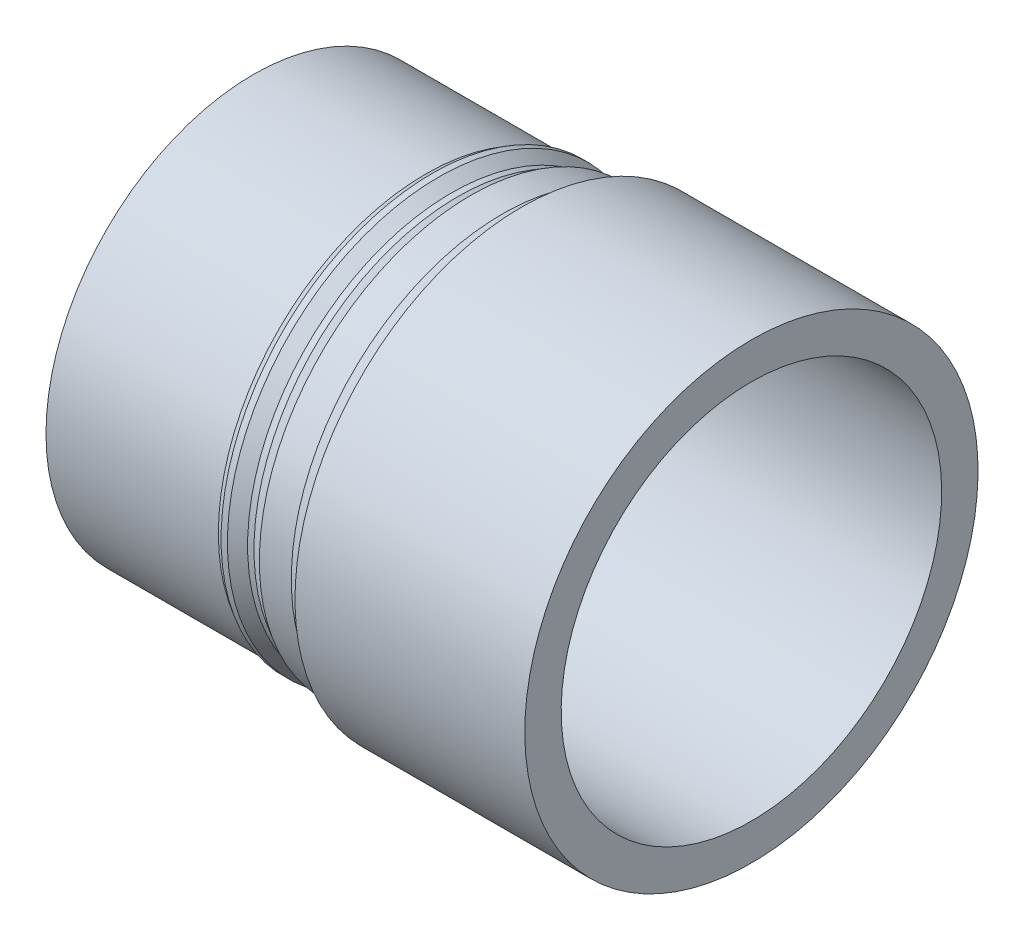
ISO-10303-21;
HEADER;
FILE_DESCRIPTION(('STEP AP214'),'2;1');
FILE_NAME('part.step','',(''),(''),'','','');
FILE_SCHEMA(('AUTOMOTIVE_DESIGN { 1 0 10303 214 1 1 1 1 }'));
ENDSEC;
DATA;
#1=APPLICATION_CONTEXT('core data for automotive mechanical design processes');
#2=APPLICATION_PROTOCOL_DEFINITION('international standard','automotive_design',2000,#1);
#3=PRODUCT_CONTEXT('',#1,'mechanical');
#4=PRODUCT('Part','Part','',(#3));
#5=PRODUCT_RELATED_PRODUCT_CATEGORY('part','',(#4));
#6=PRODUCT_DEFINITION_FORMATION('','',#4);
#7=PRODUCT_DEFINITION_CONTEXT('part definition',#1,'design');
#8=PRODUCT_DEFINITION('design','',#6,#7);
#9=PRODUCT_DEFINITION_SHAPE('','',#8);
#10=(LENGTH_UNIT() NAMED_UNIT(*) SI_UNIT(.MILLI.,.METRE.));
#11=(NAMED_UNIT(*) PLANE_ANGLE_UNIT() SI_UNIT($,.RADIAN.));
#12=(NAMED_UNIT(*) SI_UNIT($,.STERADIAN.) SOLID_ANGLE_UNIT());
#13=UNCERTAINTY_MEASURE_WITH_UNIT(LENGTH_MEASURE(1.E-05),#10,'distance_accuracy_value','');
#14=(GEOMETRIC_REPRESENTATION_CONTEXT(3) GLOBAL_UNCERTAINTY_ASSIGNED_CONTEXT((#13)) GLOBAL_UNIT_ASSIGNED_CONTEXT((#10,
#11,#12)) REPRESENTATION_CONTEXT('',''));
#15=CARTESIAN_POINT('',(0.,0.,0.));
#16=DIRECTION('',(0.,0.,1.));
#17=DIRECTION('',(1.,0.,0.));
#18=AXIS2_PLACEMENT_3D('',#15,#16,#17);
#19=CARTESIAN_POINT('',(0.,0.,0.));
#20=DIRECTION('',(-1.,0.,0.));
#21=DIRECTION('',(0.,0.,1.));
#22=AXIS2_PLACEMENT_3D('',#19,#20,#21);
#23=PLANE('',#22);
#24=CARTESIAN_POINT('',(0.,0.,0.));
#25=DIRECTION('',(1.,0.,0.));
#26=DIRECTION('',(0.,1.,0.));
#27=AXIS2_PLACEMENT_3D('',#24,#25,#26);
#28=CIRCLE('',#27,29.8);
#29=CARTESIAN_POINT('',(0.,29.8,0.));
#30=VERTEX_POINT('',#29);
#31=EDGE_CURVE('E69',#30,#30,#28,.T.);
#32=ORIENTED_EDGE('',*,*,#31,.T.);
#33=EDGE_LOOP('',(#32));
#34=FACE_BOUND('',#33,.T.);
#35=CARTESIAN_POINT('',(0.,0.,0.));
#36=DIRECTION('',(1.,0.,0.));
#37=DIRECTION('',(0.,0.,-1.));
#38=AXIS2_PLACEMENT_3D('',#35,#36,#37);
#39=CIRCLE('',#38,32.5);
#40=CARTESIAN_POINT('',(0.,0.,-32.5));
#41=VERTEX_POINT('',#40);
#42=EDGE_CURVE('E10',#41,#41,#39,.T.);
#43=ORIENTED_EDGE('',*,*,#42,.F.);
#44=EDGE_LOOP('',(#43));
#45=FACE_BOUND('',#44,.T.);
#46=ADVANCED_FACE('F31',(#34,#45),#23,.T.);
#47=CARTESIAN_POINT('',(42.,0.,0.));
#48=DIRECTION('',(1.,0.,0.));
#49=DIRECTION('',(0.,0.,-1.));
#50=AXIS2_PLACEMENT_3D('',#47,#48,#49);
#51=CYLINDRICAL_SURFACE('',#50,32.5);
#52=ORIENTED_EDGE('',*,*,#42,.T.);
#53=EDGE_LOOP('',(#52));
#54=FACE_BOUND('',#53,.T.);
#55=CARTESIAN_POINT('',(27.,0.,0.));
#56=DIRECTION('',(1.,0.,0.));
#57=DIRECTION('',(0.,0.,-1.));
#58=AXIS2_PLACEMENT_3D('',#55,#56,#57);
#59=CIRCLE('',#58,32.5);
#60=CARTESIAN_POINT('',(27.,0.,-32.5));
#61=VERTEX_POINT('',#60);
#62=EDGE_CURVE('E37',#61,#61,#59,.T.);
#63=ORIENTED_EDGE('',*,*,#62,.F.);
#64=EDGE_LOOP('',(#63));
#65=FACE_BOUND('',#64,.T.);
#66=ADVANCED_FACE('F106',(#54,#65),#51,.T.);
#67=CARTESIAN_POINT('',(28.,0.,0.));
#68=DIRECTION('',(1.,0.,0.));
#69=DIRECTION('',(0.,0.,-1.));
#70=AXIS2_PLACEMENT_3D('',#67,#68,#69);
#71=CONICAL_SURFACE('',#70,33.0773502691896,0.523598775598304);
#72=ORIENTED_EDGE('',*,*,#62,.T.);
#73=EDGE_LOOP('',(#72));
#74=FACE_BOUND('',#73,.T.);
#75=CARTESIAN_POINT('',(28.,0.,0.));
#76=DIRECTION('',(1.,0.,0.));
#77=DIRECTION('',(0.,0.,-1.));
#78=AXIS2_PLACEMENT_3D('',#75,#76,#77);
#79=CIRCLE('',#78,33.0773502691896);
#80=CARTESIAN_POINT('',(28.,0.,-33.0773502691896));
#81=VERTEX_POINT('',#80);
#82=EDGE_CURVE('E41',#81,#81,#79,.T.);
#83=ORIENTED_EDGE('',*,*,#82,.F.);
#84=EDGE_LOOP('',(#83));
#85=FACE_BOUND('',#84,.T.);
#86=ADVANCED_FACE('F110',(#74,#85),#71,.T.);
#87=CARTESIAN_POINT('',(42.,0.,0.));
#88=DIRECTION('',(1.,0.,0.));
#89=DIRECTION('',(0.,0.,-1.));
#90=AXIS2_PLACEMENT_3D('',#87,#88,#89);
#91=CYLINDRICAL_SURFACE('',#90,33.0773502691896);
#92=ORIENTED_EDGE('',*,*,#82,.T.);
#93=EDGE_LOOP('',(#92));
#94=FACE_BOUND('',#93,.T.);
#95=CARTESIAN_POINT('',(29.,0.,0.));
#96=DIRECTION('',(1.,0.,0.));
#97=DIRECTION('',(0.,0.,-1.));
#98=AXIS2_PLACEMENT_3D('',#95,#96,#97);
#99=CIRCLE('',#98,33.0773502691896);
#100=CARTESIAN_POINT('',(29.,0.,-33.0773502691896));
#101=VERTEX_POINT('',#100);
#102=EDGE_CURVE('E45',#101,#101,#99,.T.);
#103=ORIENTED_EDGE('',*,*,#102,.F.);
#104=EDGE_LOOP('',(#103));
#105=FACE_BOUND('',#104,.T.);
#106=ADVANCED_FACE('F114',(#94,#105),#91,.T.);
#107=CARTESIAN_POINT('',(31.,0.,0.));
#108=DIRECTION('',(-1.,0.,0.));
#109=DIRECTION('',(0.,0.,1.));
#110=AXIS2_PLACEMENT_3D('',#107,#108,#109);
#111=CONICAL_SURFACE('',#110,31.9226497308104,0.523598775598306);
#112=ORIENTED_EDGE('',*,*,#102,.T.);
#113=EDGE_LOOP('',(#112));
#114=FACE_BOUND('',#113,.T.);
#115=CARTESIAN_POINT('',(31.,0.,0.));
#116=DIRECTION('',(1.,0.,0.));
#117=DIRECTION('',(0.,0.,-1.));
#118=AXIS2_PLACEMENT_3D('',#115,#116,#117);
#119=CIRCLE('',#118,31.9226497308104);
#120=CARTESIAN_POINT('',(31.,0.,-31.9226497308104));
#121=VERTEX_POINT('',#120);
#122=EDGE_CURVE('E50',#121,#121,#119,.T.);
#123=ORIENTED_EDGE('',*,*,#122,.F.);
#124=EDGE_LOOP('',(#123));
#125=FACE_BOUND('',#124,.T.);
#126=ADVANCED_FACE('F120',(#114,#125),#111,.T.);
#127=CARTESIAN_POINT('',(42.,0.,0.));
#128=DIRECTION('',(1.,0.,0.));
#129=DIRECTION('',(0.,0.,-1.));
#130=AXIS2_PLACEMENT_3D('',#127,#128,#129);
#131=CYLINDRICAL_SURFACE('',#130,31.9226497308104);
#132=ORIENTED_EDGE('',*,*,#122,.T.);
#133=EDGE_LOOP('',(#132));
#134=FACE_BOUND('',#133,.T.);
#135=CARTESIAN_POINT('',(32.,0.,0.));
#136=DIRECTION('',(1.,0.,0.));
#137=DIRECTION('',(0.,0.,-1.));
#138=AXIS2_PLACEMENT_3D('',#135,#136,#137);
#139=CIRCLE('',#138,31.9226497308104);
#140=CARTESIAN_POINT('',(32.,0.,-31.9226497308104));
#141=VERTEX_POINT('',#140);
#142=EDGE_CURVE('E53',#141,#141,#139,.T.);
#143=ORIENTED_EDGE('',*,*,#142,.F.);
#144=EDGE_LOOP('',(#143));
#145=FACE_BOUND('',#144,.T.);
#146=ADVANCED_FACE('F124',(#134,#145),#131,.T.);
#147=CARTESIAN_POINT('',(34.,0.,0.));
#148=DIRECTION('',(1.,0.,0.));
#149=DIRECTION('',(0.,0.,-1.));
#150=AXIS2_PLACEMENT_3D('',#147,#148,#149);
#151=CONICAL_SURFACE('',#150,33.0773502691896,0.523598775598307);
#152=ORIENTED_EDGE('',*,*,#142,.T.);
#153=EDGE_LOOP('',(#152));
#154=FACE_BOUND('',#153,.T.);
#155=CARTESIAN_POINT('',(34.,0.,0.));
#156=DIRECTION('',(1.,0.,0.));
#157=DIRECTION('',(0.,0.,-1.));
#158=AXIS2_PLACEMENT_3D('',#155,#156,#157);
#159=CIRCLE('',#158,33.0773502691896);
#160=CARTESIAN_POINT('',(34.,0.,-33.0773502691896));
#161=VERTEX_POINT('',#160);
#162=EDGE_CURVE('E56',#161,#161,#159,.T.);
#163=ORIENTED_EDGE('',*,*,#162,.F.);
#164=EDGE_LOOP('',(#163));
#165=FACE_BOUND('',#164,.T.);
#166=ADVANCED_FACE('F128',(#154,#165),#151,.T.);
#167=CARTESIAN_POINT('',(42.,0.,0.));
#168=DIRECTION('',(1.,0.,0.));
#169=DIRECTION('',(0.,0.,-1.));
#170=AXIS2_PLACEMENT_3D('',#167,#168,#169);
#171=CYLINDRICAL_SURFACE('',#170,33.0773502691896);
#172=ORIENTED_EDGE('',*,*,#162,.T.);
#173=EDGE_LOOP('',(#172));
#174=FACE_BOUND('',#173,.T.);
#175=CARTESIAN_POINT('',(39.,0.,0.));
#176=DIRECTION('',(1.,0.,0.));
#177=DIRECTION('',(0.,0.,-1.));
#178=AXIS2_PLACEMENT_3D('',#175,#176,#177);
#179=CIRCLE('',#178,33.0773502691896);
#180=CARTESIAN_POINT('',(39.,0.,-33.0773502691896));
#181=VERTEX_POINT('',#180);
#182=EDGE_CURVE('E59',#181,#181,#179,.T.);
#183=ORIENTED_EDGE('',*,*,#182,.F.);
#184=EDGE_LOOP('',(#183));
#185=FACE_BOUND('',#184,.T.);
#186=ADVANCED_FACE('F132',(#174,#185),#171,.T.);
#187=CARTESIAN_POINT('',(42.,0.,0.));
#188=DIRECTION('',(1.,0.,0.));
#189=DIRECTION('',(0.,0.,-1.));
#190=AXIS2_PLACEMENT_3D('',#187,#188,#189);
#191=CONICAL_SURFACE('',#190,34.0773502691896,0.321750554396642);
#192=ORIENTED_EDGE('',*,*,#182,.T.);
#193=EDGE_LOOP('',(#192));
#194=FACE_BOUND('',#193,.T.);
#195=CARTESIAN_POINT('',(42.,0.,0.));
#196=DIRECTION('',(1.,0.,0.));
#197=DIRECTION('',(0.,0.,-1.));
#198=AXIS2_PLACEMENT_3D('',#195,#196,#197);
#199=CIRCLE('',#198,34.0773502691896);
#200=CARTESIAN_POINT('',(42.,0.,-34.0773502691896));
#201=VERTEX_POINT('',#200);
#202=EDGE_CURVE('E62',#201,#201,#199,.T.);
#203=ORIENTED_EDGE('',*,*,#202,.F.);
#204=EDGE_LOOP('',(#203));
#205=FACE_BOUND('',#204,.T.);
#206=ADVANCED_FACE('F96',(#194,#205),#191,.T.);
#207=CARTESIAN_POINT('',(78.,0.,0.));
#208=DIRECTION('',(-1.,0.,0.));
#209=DIRECTION('',(0.,-1.,0.));
#210=AXIS2_PLACEMENT_3D('',#207,#208,#209);
#211=CYLINDRICAL_SURFACE('',#210,35.5);
#212=CARTESIAN_POINT('',(78.,0.,0.));
#213=DIRECTION('',(1.,0.,0.));
#214=DIRECTION('',(0.,1.,0.));
#215=AXIS2_PLACEMENT_3D('',#212,#213,#214);
#216=CIRCLE('',#215,35.5);
#217=CARTESIAN_POINT('',(78.,35.5,0.));
#218=VERTEX_POINT('',#217);
#219=EDGE_CURVE('E65',#218,#218,#216,.T.);
#220=ORIENTED_EDGE('',*,*,#219,.F.);
#221=EDGE_LOOP('',(#220));
#222=FACE_BOUND('',#221,.T.);
#223=CARTESIAN_POINT('',(42.,0.,0.));
#224=DIRECTION('',(1.,0.,0.));
#225=DIRECTION('',(0.,1.,0.));
#226=AXIS2_PLACEMENT_3D('',#223,#224,#225);
#227=CIRCLE('',#226,35.5);
#228=CARTESIAN_POINT('',(42.,35.5,0.));
#229=VERTEX_POINT('',#228);
#230=EDGE_CURVE('E66',#229,#229,#227,.T.);
#231=ORIENTED_EDGE('',*,*,#230,.T.);
#232=EDGE_LOOP('',(#231));
#233=FACE_BOUND('',#232,.T.);
#234=ADVANCED_FACE('F90',(#222,#233),#211,.T.);
#235=CARTESIAN_POINT('',(78.,0.,0.));
#236=DIRECTION('',(1.,0.,0.));
#237=DIRECTION('',(0.,1.,0.));
#238=AXIS2_PLACEMENT_3D('',#235,#236,#237);
#239=PLANE('',#238);
#240=CARTESIAN_POINT('',(78.,0.,0.));
#241=DIRECTION('',(1.,0.,0.));
#242=DIRECTION('',(0.,1.,0.));
#243=AXIS2_PLACEMENT_3D('',#240,#241,#242);
#244=CIRCLE('',#243,29.8);
#245=CARTESIAN_POINT('',(78.,29.8,0.));
#246=VERTEX_POINT('',#245);
#247=EDGE_CURVE('E72',#246,#246,#244,.T.);
#248=ORIENTED_EDGE('',*,*,#247,.F.);
#249=EDGE_LOOP('',(#248));
#250=FACE_BOUND('',#249,.T.);
#251=ORIENTED_EDGE('',*,*,#219,.T.);
#252=EDGE_LOOP('',(#251));
#253=FACE_BOUND('',#252,.T.);
#254=ADVANCED_FACE('F87',(#250,#253),#239,.T.);
#255=CARTESIAN_POINT('',(42.,0.,0.));
#256=DIRECTION('',(1.,0.,0.));
#257=DIRECTION('',(0.,1.,0.));
#258=AXIS2_PLACEMENT_3D('',#255,#256,#257);
#259=PLANE('',#258);
#260=ORIENTED_EDGE('',*,*,#202,.T.);
#261=EDGE_LOOP('',(#260));
#262=FACE_BOUND('',#261,.T.);
#263=ORIENTED_EDGE('',*,*,#230,.F.);
#264=EDGE_LOOP('',(#263));
#265=FACE_BOUND('',#264,.T.);
#266=ADVANCED_FACE('F83',(#262,#265),#259,.F.);
#267=CARTESIAN_POINT('',(0.,0.,0.));
#268=DIRECTION('',(1.,0.,0.));
#269=DIRECTION('',(0.,1.,0.));
#270=AXIS2_PLACEMENT_3D('',#267,#268,#269);
#271=CYLINDRICAL_SURFACE('',#270,29.8);
#272=ORIENTED_EDGE('',*,*,#31,.F.);
#273=EDGE_LOOP('',(#272));
#274=FACE_BOUND('',#273,.T.);
#275=ORIENTED_EDGE('',*,*,#247,.T.);
#276=EDGE_LOOP('',(#275));
#277=FACE_BOUND('',#276,.T.);
#278=ADVANCED_FACE('F80',(#274,#277),#271,.F.);
#279=CLOSED_SHELL('',(#46,#66,#86,#106,#126,#146,#166,#186,#206,#234,#254,#266,#278));
#280=MANIFOLD_SOLID_BREP('B2',#279);
#281=ADVANCED_BREP_SHAPE_REPRESENTATION('',(#18,#280),#14);
#282=SHAPE_DEFINITION_REPRESENTATION(#9,#281);
ENDSEC;
END-ISO-10303-21;
